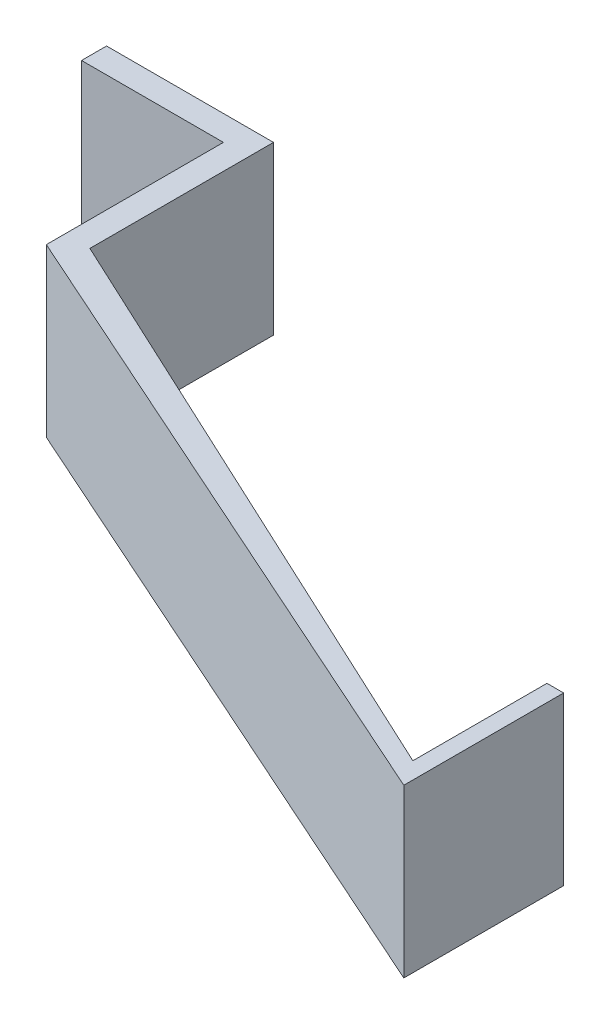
ISO-10303-21;
HEADER;
FILE_DESCRIPTION(('STEP AP214'),'2;1');
FILE_NAME('part.step','',(''),(''),'','','');
FILE_SCHEMA(('AUTOMOTIVE_DESIGN { 1 0 10303 214 1 1 1 1 }'));
ENDSEC;
DATA;
#1=APPLICATION_CONTEXT('core data for automotive mechanical design processes');
#2=APPLICATION_PROTOCOL_DEFINITION('international standard','automotive_design',2000,#1);
#3=PRODUCT_CONTEXT('',#1,'mechanical');
#4=PRODUCT('Part','Part','',(#3));
#5=PRODUCT_RELATED_PRODUCT_CATEGORY('part','',(#4));
#6=PRODUCT_DEFINITION_FORMATION('','',#4);
#7=PRODUCT_DEFINITION_CONTEXT('part definition',#1,'design');
#8=PRODUCT_DEFINITION('design','',#6,#7);
#9=PRODUCT_DEFINITION_SHAPE('','',#8);
#10=(LENGTH_UNIT() NAMED_UNIT(*) SI_UNIT(.MILLI.,.METRE.));
#11=(NAMED_UNIT(*) PLANE_ANGLE_UNIT() SI_UNIT($,.RADIAN.));
#12=(NAMED_UNIT(*) SI_UNIT($,.STERADIAN.) SOLID_ANGLE_UNIT());
#13=UNCERTAINTY_MEASURE_WITH_UNIT(LENGTH_MEASURE(1.E-05),#10,'distance_accuracy_value','');
#14=(GEOMETRIC_REPRESENTATION_CONTEXT(3) GLOBAL_UNCERTAINTY_ASSIGNED_CONTEXT((#13)) GLOBAL_UNIT_ASSIGNED_CONTEXT((#10,
#11,#12)) REPRESENTATION_CONTEXT('',''));
#15=CARTESIAN_POINT('',(0.,0.,0.));
#16=DIRECTION('',(0.,0.,1.));
#17=DIRECTION('',(1.,0.,0.));
#18=AXIS2_PLACEMENT_3D('',#15,#16,#17);
#19=CARTESIAN_POINT('',(72.5046229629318,20.,33.8094609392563));
#20=DIRECTION('',(-0.422618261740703,0.,0.906307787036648));
#21=DIRECTION('',(0.906307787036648,0.,0.422618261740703));
#22=AXIS2_PLACEMENT_3D('',#19,#20,#21);
#23=PLANE('',#22);
#24=DIRECTION('',(-0.906307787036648,0.,-0.422618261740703));
#25=VECTOR('',#24,1.);
#26=CARTESIAN_POINT('',(72.5046229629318,0.,33.8094609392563));
#27=LINE('',#26,#25);
#28=CARTESIAN_POINT('',(72.5046229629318,0.,33.8094609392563));
#29=VERTEX_POINT('',#28);
#30=CARTESIAN_POINT('',(0.,0.,0.));
#31=VERTEX_POINT('',#30);
#32=EDGE_CURVE('E140',#29,#31,#27,.T.);
#33=ORIENTED_EDGE('',*,*,#32,.T.);
#34=DIRECTION('',(0.,-1.,0.));
#35=VECTOR('',#34,1.);
#36=CARTESIAN_POINT('',(0.,20.,0.));
#37=LINE('',#36,#35);
#38=CARTESIAN_POINT('',(0.,20.,0.));
#39=VERTEX_POINT('',#38);
#40=EDGE_CURVE('E11',#39,#31,#37,.T.);
#41=ORIENTED_EDGE('',*,*,#40,.F.);
#42=DIRECTION('',(-0.906307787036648,0.,-0.422618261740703));
#43=VECTOR('',#42,1.);
#44=CARTESIAN_POINT('',(72.5046229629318,20.,33.8094609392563));
#45=LINE('',#44,#43);
#46=CARTESIAN_POINT('',(72.5046229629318,20.,33.8094609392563));
#47=VERTEX_POINT('',#46);
#48=EDGE_CURVE('E159',#47,#39,#45,.T.);
#49=ORIENTED_EDGE('',*,*,#48,.F.);
#50=DIRECTION('',(0.,-1.,0.));
#51=VECTOR('',#50,1.);
#52=CARTESIAN_POINT('',(72.5046229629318,20.,33.8094609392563));
#53=LINE('',#52,#51);
#54=EDGE_CURVE('E136',#47,#29,#53,.T.);
#55=ORIENTED_EDGE('',*,*,#54,.T.);
#56=EDGE_LOOP('',(#33,#41,#49,#55));
#57=FACE_BOUND('',#56,.T.);
#58=ADVANCED_FACE('F33',(#57),#23,.F.);
#59=CARTESIAN_POINT('',(0.,20.,0.));
#60=DIRECTION('',(-1.,0.,0.));
#61=DIRECTION('',(0.,0.,1.));
#62=AXIS2_PLACEMENT_3D('',#59,#60,#61);
#63=PLANE('',#62);
#64=DIRECTION('',(0.,0.,-1.));
#65=VECTOR('',#64,1.);
#66=CARTESIAN_POINT('',(0.,0.,0.));
#67=LINE('',#66,#65);
#68=CARTESIAN_POINT('',(0.,0.,-22.));
#69=VERTEX_POINT('',#68);
#70=EDGE_CURVE('E143',#31,#69,#67,.T.);
#71=ORIENTED_EDGE('',*,*,#70,.T.);
#72=DIRECTION('',(0.,-1.,0.));
#73=VECTOR('',#72,1.);
#74=CARTESIAN_POINT('',(0.,20.,-22.));
#75=LINE('',#74,#73);
#76=CARTESIAN_POINT('',(0.,20.,-22.));
#77=VERTEX_POINT('',#76);
#78=EDGE_CURVE('E41',#77,#69,#75,.T.);
#79=ORIENTED_EDGE('',*,*,#78,.F.);
#80=DIRECTION('',(0.,0.,-1.));
#81=VECTOR('',#80,1.);
#82=CARTESIAN_POINT('',(0.,20.,0.));
#83=LINE('',#82,#81);
#84=EDGE_CURVE('E98',#39,#77,#83,.T.);
#85=ORIENTED_EDGE('',*,*,#84,.F.);
#86=ORIENTED_EDGE('',*,*,#40,.T.);
#87=EDGE_LOOP('',(#71,#79,#85,#86));
#88=FACE_BOUND('',#87,.T.);
#89=ADVANCED_FACE('F208',(#88),#63,.F.);
#90=CARTESIAN_POINT('',(0.,20.,-22.));
#91=DIRECTION('',(0.,0.,1.));
#92=DIRECTION('',(1.,0.,0.));
#93=AXIS2_PLACEMENT_3D('',#90,#91,#92);
#94=PLANE('',#93);
#95=DIRECTION('',(-1.,0.,0.));
#96=VECTOR('',#95,1.);
#97=CARTESIAN_POINT('',(0.,0.,-22.));
#98=LINE('',#97,#96);
#99=CARTESIAN_POINT('',(-20.,0.,-22.));
#100=VERTEX_POINT('',#99);
#101=EDGE_CURVE('E145',#69,#100,#98,.T.);
#102=ORIENTED_EDGE('',*,*,#101,.T.);
#103=DIRECTION('',(0.,-1.,0.));
#104=VECTOR('',#103,1.);
#105=CARTESIAN_POINT('',(-20.,20.,-22.));
#106=LINE('',#105,#104);
#107=CARTESIAN_POINT('',(-20.,20.,-22.));
#108=VERTEX_POINT('',#107);
#109=EDGE_CURVE('E172',#108,#100,#106,.T.);
#110=ORIENTED_EDGE('',*,*,#109,.F.);
#111=DIRECTION('',(-1.,0.,0.));
#112=VECTOR('',#111,1.);
#113=CARTESIAN_POINT('',(0.,20.,-22.));
#114=LINE('',#113,#112);
#115=EDGE_CURVE('E180',#77,#108,#114,.T.);
#116=ORIENTED_EDGE('',*,*,#115,.F.);
#117=ORIENTED_EDGE('',*,*,#78,.T.);
#118=EDGE_LOOP('',(#102,#110,#116,#117));
#119=FACE_BOUND('',#118,.T.);
#120=ADVANCED_FACE('F178',(#119),#94,.F.);
#121=CARTESIAN_POINT('',(-20.,20.,-22.));
#122=DIRECTION('',(1.,0.,0.));
#123=DIRECTION('',(0.,0.,-1.));
#124=AXIS2_PLACEMENT_3D('',#121,#122,#123);
#125=PLANE('',#124);
#126=DIRECTION('',(0.,0.,1.));
#127=VECTOR('',#126,1.);
#128=CARTESIAN_POINT('',(-20.,0.,-22.));
#129=LINE('',#128,#127);
#130=CARTESIAN_POINT('',(-20.,0.,-19.));
#131=VERTEX_POINT('',#130);
#132=EDGE_CURVE('E147',#100,#131,#129,.T.);
#133=ORIENTED_EDGE('',*,*,#132,.T.);
#134=DIRECTION('',(0.,-1.,0.));
#135=VECTOR('',#134,1.);
#136=CARTESIAN_POINT('',(-20.,20.,-19.));
#137=LINE('',#136,#135);
#138=CARTESIAN_POINT('',(-20.,20.,-19.));
#139=VERTEX_POINT('',#138);
#140=EDGE_CURVE('E169',#139,#131,#137,.T.);
#141=ORIENTED_EDGE('',*,*,#140,.F.);
#142=DIRECTION('',(0.,0.,1.));
#143=VECTOR('',#142,1.);
#144=CARTESIAN_POINT('',(-20.,20.,-22.));
#145=LINE('',#144,#143);
#146=EDGE_CURVE('E198',#108,#139,#145,.T.);
#147=ORIENTED_EDGE('',*,*,#146,.F.);
#148=ORIENTED_EDGE('',*,*,#109,.T.);
#149=EDGE_LOOP('',(#133,#141,#147,#148));
#150=FACE_BOUND('',#149,.T.);
#151=ADVANCED_FACE('F189',(#150),#125,.F.);
#152=CARTESIAN_POINT('',(-20.,20.,-19.));
#153=DIRECTION('',(0.,0.,-1.));
#154=DIRECTION('',(-1.,0.,0.));
#155=AXIS2_PLACEMENT_3D('',#152,#153,#154);
#156=PLANE('',#155);
#157=DIRECTION('',(1.,0.,0.));
#158=VECTOR('',#157,1.);
#159=CARTESIAN_POINT('',(-20.,0.,-19.));
#160=LINE('',#159,#158);
#161=CARTESIAN_POINT('',(-3.,0.,-19.));
#162=VERTEX_POINT('',#161);
#163=EDGE_CURVE('E149',#131,#162,#160,.T.);
#164=ORIENTED_EDGE('',*,*,#163,.T.);
#165=DIRECTION('',(0.,-1.,0.));
#166=VECTOR('',#165,1.);
#167=CARTESIAN_POINT('',(-3.,20.,-19.));
#168=LINE('',#167,#166);
#169=CARTESIAN_POINT('',(-3.,20.,-19.));
#170=VERTEX_POINT('',#169);
#171=EDGE_CURVE('E166',#170,#162,#168,.T.);
#172=ORIENTED_EDGE('',*,*,#171,.F.);
#173=DIRECTION('',(1.,0.,0.));
#174=VECTOR('',#173,1.);
#175=CARTESIAN_POINT('',(-20.,20.,-19.));
#176=LINE('',#175,#174);
#177=EDGE_CURVE('E195',#139,#170,#176,.T.);
#178=ORIENTED_EDGE('',*,*,#177,.F.);
#179=ORIENTED_EDGE('',*,*,#140,.T.);
#180=EDGE_LOOP('',(#164,#172,#178,#179));
#181=FACE_BOUND('',#180,.T.);
#182=ADVANCED_FACE('F193',(#181),#156,.F.);
#183=CARTESIAN_POINT('',(-3.,20.,-19.));
#184=DIRECTION('',(1.,0.,0.));
#185=DIRECTION('',(0.,0.,-1.));
#186=AXIS2_PLACEMENT_3D('',#183,#184,#185);
#187=PLANE('',#186);
#188=DIRECTION('',(0.,0.,1.));
#189=VECTOR('',#188,1.);
#190=CARTESIAN_POINT('',(-3.,0.,-19.));
#191=LINE('',#190,#189);
#192=CARTESIAN_POINT('',(-3.,0.,2.21414376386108));
#193=VERTEX_POINT('',#192);
#194=EDGE_CURVE('E151',#162,#193,#191,.T.);
#195=ORIENTED_EDGE('',*,*,#194,.T.);
#196=DIRECTION('',(0.,-1.,0.));
#197=VECTOR('',#196,1.);
#198=CARTESIAN_POINT('',(-3.,20.,2.21414376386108));
#199=LINE('',#198,#197);
#200=CARTESIAN_POINT('',(-3.,20.,2.21414376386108));
#201=VERTEX_POINT('',#200);
#202=EDGE_CURVE('E163',#201,#193,#199,.T.);
#203=ORIENTED_EDGE('',*,*,#202,.F.);
#204=DIRECTION('',(0.,0.,1.));
#205=VECTOR('',#204,1.);
#206=CARTESIAN_POINT('',(-3.,20.,-19.));
#207=LINE('',#206,#205);
#208=EDGE_CURVE('E197',#170,#201,#207,.T.);
#209=ORIENTED_EDGE('',*,*,#208,.F.);
#210=ORIENTED_EDGE('',*,*,#171,.T.);
#211=EDGE_LOOP('',(#195,#203,#209,#210));
#212=FACE_BOUND('',#211,.T.);
#213=ADVANCED_FACE('F220',(#212),#187,.F.);
#214=CARTESIAN_POINT('',(-3.,20.,2.21414376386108));
#215=DIRECTION('',(0.408447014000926,0.,-0.912782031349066));
#216=DIRECTION('',(-0.912782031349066,0.,-0.408447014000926));
#217=AXIS2_PLACEMENT_3D('',#214,#215,#216);
#218=PLANE('',#217);
#219=DIRECTION('',(0.912782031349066,0.,0.408447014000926));
#220=VECTOR('',#219,1.);
#221=CARTESIAN_POINT('',(-3.,0.,2.21414376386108));
#222=LINE('',#221,#220);
#223=CARTESIAN_POINT('',(74.5046229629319,0.,36.8955142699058));
#224=VERTEX_POINT('',#223);
#225=EDGE_CURVE('E153',#193,#224,#222,.T.);
#226=ORIENTED_EDGE('',*,*,#225,.T.);
#227=DIRECTION('',(0.,-1.,0.));
#228=VECTOR('',#227,1.);
#229=CARTESIAN_POINT('',(74.5046229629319,20.,36.8955142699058));
#230=LINE('',#229,#228);
#231=CARTESIAN_POINT('',(74.5046229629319,20.,36.8955142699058));
#232=VERTEX_POINT('',#231);
#233=EDGE_CURVE('E131',#232,#224,#230,.T.);
#234=ORIENTED_EDGE('',*,*,#233,.F.);
#235=DIRECTION('',(0.912782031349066,0.,0.408447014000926));
#236=VECTOR('',#235,1.);
#237=CARTESIAN_POINT('',(-3.,20.,2.21414376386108));
#238=LINE('',#237,#236);
#239=EDGE_CURVE('E123',#201,#232,#238,.T.);
#240=ORIENTED_EDGE('',*,*,#239,.F.);
#241=ORIENTED_EDGE('',*,*,#202,.T.);
#242=EDGE_LOOP('',(#226,#234,#240,#241));
#243=FACE_BOUND('',#242,.T.);
#244=ADVANCED_FACE('F223',(#243),#218,.F.);
#245=CARTESIAN_POINT('',(74.5046229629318,20.,25.4494769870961));
#246=DIRECTION('',(-1.,0.,0.));
#247=DIRECTION('',(0.,0.,1.));
#248=AXIS2_PLACEMENT_3D('',#245,#246,#247);
#249=PLANE('',#248);
#250=DIRECTION('',(0.,0.,-1.));
#251=VECTOR('',#250,1.);
#252=CARTESIAN_POINT('',(74.5046229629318,0.,25.4494769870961));
#253=LINE('',#252,#251);
#254=CARTESIAN_POINT('',(74.5046229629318,0.,17.7452717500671));
#255=VERTEX_POINT('',#254);
#256=EDGE_CURVE('E130',#224,#255,#253,.T.);
#257=ORIENTED_EDGE('',*,*,#256,.T.);
#258=DIRECTION('',(0.,-1.,0.));
#259=VECTOR('',#258,1.);
#260=CARTESIAN_POINT('',(74.5046229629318,20.,17.7452717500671));
#261=LINE('',#260,#259);
#262=CARTESIAN_POINT('',(74.5046229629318,20.,17.7452717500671));
#263=VERTEX_POINT('',#262);
#264=EDGE_CURVE('E128',#263,#255,#261,.T.);
#265=ORIENTED_EDGE('',*,*,#264,.F.);
#266=DIRECTION('',(0.,0.,-1.));
#267=VECTOR('',#266,1.);
#268=CARTESIAN_POINT('',(74.5046229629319,20.,36.8955142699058));
#269=LINE('',#268,#267);
#270=EDGE_CURVE('E117',#232,#263,#269,.T.);
#271=ORIENTED_EDGE('',*,*,#270,.F.);
#272=ORIENTED_EDGE('',*,*,#233,.T.);
#273=EDGE_LOOP('',(#257,#265,#271,#272));
#274=FACE_BOUND('',#273,.T.);
#275=ADVANCED_FACE('F129',(#274),#249,.F.);
#276=CARTESIAN_POINT('',(74.5046229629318,20.,17.7452717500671));
#277=DIRECTION('',(0.,0.,1.));
#278=DIRECTION('',(1.,0.,0.));
#279=AXIS2_PLACEMENT_3D('',#276,#277,#278);
#280=PLANE('',#279);
#281=DIRECTION('',(-1.,0.,0.));
#282=VECTOR('',#281,1.);
#283=CARTESIAN_POINT('',(74.5046229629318,0.,17.7452717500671));
#284=LINE('',#283,#282);
#285=CARTESIAN_POINT('',(72.5046229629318,0.,17.7452717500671));
#286=VERTEX_POINT('',#285);
#287=EDGE_CURVE('E84',#255,#286,#284,.T.);
#288=ORIENTED_EDGE('',*,*,#287,.T.);
#289=DIRECTION('',(0.,-1.,0.));
#290=VECTOR('',#289,1.);
#291=CARTESIAN_POINT('',(72.5046229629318,20.,17.7452717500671));
#292=LINE('',#291,#290);
#293=CARTESIAN_POINT('',(72.5046229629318,20.,17.7452717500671));
#294=VERTEX_POINT('',#293);
#295=EDGE_CURVE('E132',#294,#286,#292,.T.);
#296=ORIENTED_EDGE('',*,*,#295,.F.);
#297=DIRECTION('',(-1.,0.,0.));
#298=VECTOR('',#297,1.);
#299=CARTESIAN_POINT('',(74.5046229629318,20.,17.7452717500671));
#300=LINE('',#299,#298);
#301=EDGE_CURVE('E121',#263,#294,#300,.T.);
#302=ORIENTED_EDGE('',*,*,#301,.F.);
#303=ORIENTED_EDGE('',*,*,#264,.T.);
#304=EDGE_LOOP('',(#288,#296,#302,#303));
#305=FACE_BOUND('',#304,.T.);
#306=ADVANCED_FACE('F134',(#305),#280,.F.);
#307=CARTESIAN_POINT('',(72.5046229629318,20.,17.7452717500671));
#308=DIRECTION('',(1.,0.,0.));
#309=DIRECTION('',(0.,0.,-1.));
#310=AXIS2_PLACEMENT_3D('',#307,#308,#309);
#311=PLANE('',#310);
#312=DIRECTION('',(0.,0.,1.));
#313=VECTOR('',#312,1.);
#314=CARTESIAN_POINT('',(72.5046229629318,0.,17.7452717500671));
#315=LINE('',#314,#313);
#316=EDGE_CURVE('E90',#286,#29,#315,.T.);
#317=ORIENTED_EDGE('',*,*,#316,.T.);
#318=ORIENTED_EDGE('',*,*,#54,.F.);
#319=DIRECTION('',(0.,0.,1.));
#320=VECTOR('',#319,1.);
#321=CARTESIAN_POINT('',(72.5046229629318,20.,17.7452717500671));
#322=LINE('',#321,#320);
#323=EDGE_CURVE('E49',#294,#47,#322,.T.);
#324=ORIENTED_EDGE('',*,*,#323,.F.);
#325=ORIENTED_EDGE('',*,*,#295,.T.);
#326=EDGE_LOOP('',(#317,#318,#324,#325));
#327=FACE_BOUND('',#326,.T.);
#328=ADVANCED_FACE('F232',(#327),#311,.F.);
#329=CARTESIAN_POINT('',(0.,20.,0.));
#330=DIRECTION('',(0.,-1.,0.));
#331=DIRECTION('',(0.,0.,-1.));
#332=AXIS2_PLACEMENT_3D('',#329,#330,#331);
#333=PLANE('',#332);
#334=ORIENTED_EDGE('',*,*,#48,.T.);
#335=ORIENTED_EDGE('',*,*,#84,.T.);
#336=ORIENTED_EDGE('',*,*,#115,.T.);
#337=ORIENTED_EDGE('',*,*,#146,.T.);
#338=ORIENTED_EDGE('',*,*,#177,.T.);
#339=ORIENTED_EDGE('',*,*,#208,.T.);
#340=ORIENTED_EDGE('',*,*,#239,.T.);
#341=ORIENTED_EDGE('',*,*,#270,.T.);
#342=ORIENTED_EDGE('',*,*,#301,.T.);
#343=ORIENTED_EDGE('',*,*,#323,.T.);
#344=EDGE_LOOP('',(#334,#335,#336,#337,#338,#339,#340,#341,#342,#343));
#345=FACE_BOUND('',#344,.T.);
#346=ADVANCED_FACE('F119',(#345),#333,.F.);
#347=CARTESIAN_POINT('',(0.,0.,0.));
#348=DIRECTION('',(0.,-1.,0.));
#349=DIRECTION('',(0.,0.,-1.));
#350=AXIS2_PLACEMENT_3D('',#347,#348,#349);
#351=PLANE('',#350);
#352=ORIENTED_EDGE('',*,*,#32,.F.);
#353=ORIENTED_EDGE('',*,*,#316,.F.);
#354=ORIENTED_EDGE('',*,*,#287,.F.);
#355=ORIENTED_EDGE('',*,*,#256,.F.);
#356=ORIENTED_EDGE('',*,*,#225,.F.);
#357=ORIENTED_EDGE('',*,*,#194,.F.);
#358=ORIENTED_EDGE('',*,*,#163,.F.);
#359=ORIENTED_EDGE('',*,*,#132,.F.);
#360=ORIENTED_EDGE('',*,*,#101,.F.);
#361=ORIENTED_EDGE('',*,*,#70,.F.);
#362=EDGE_LOOP('',(#352,#353,#354,#355,#356,#357,#358,#359,#360,#361));
#363=FACE_BOUND('',#362,.T.);
#364=ADVANCED_FACE('F184',(#363),#351,.T.);
#365=CLOSED_SHELL('',(#58,#89,#120,#151,#182,#213,#244,#275,#306,#328,#346,#364));
#366=MANIFOLD_SOLID_BREP('B2',#365);
#367=ADVANCED_BREP_SHAPE_REPRESENTATION('',(#18,#366),#14);
#368=SHAPE_DEFINITION_REPRESENTATION(#9,#367);
ENDSEC;
END-ISO-10303-21;
